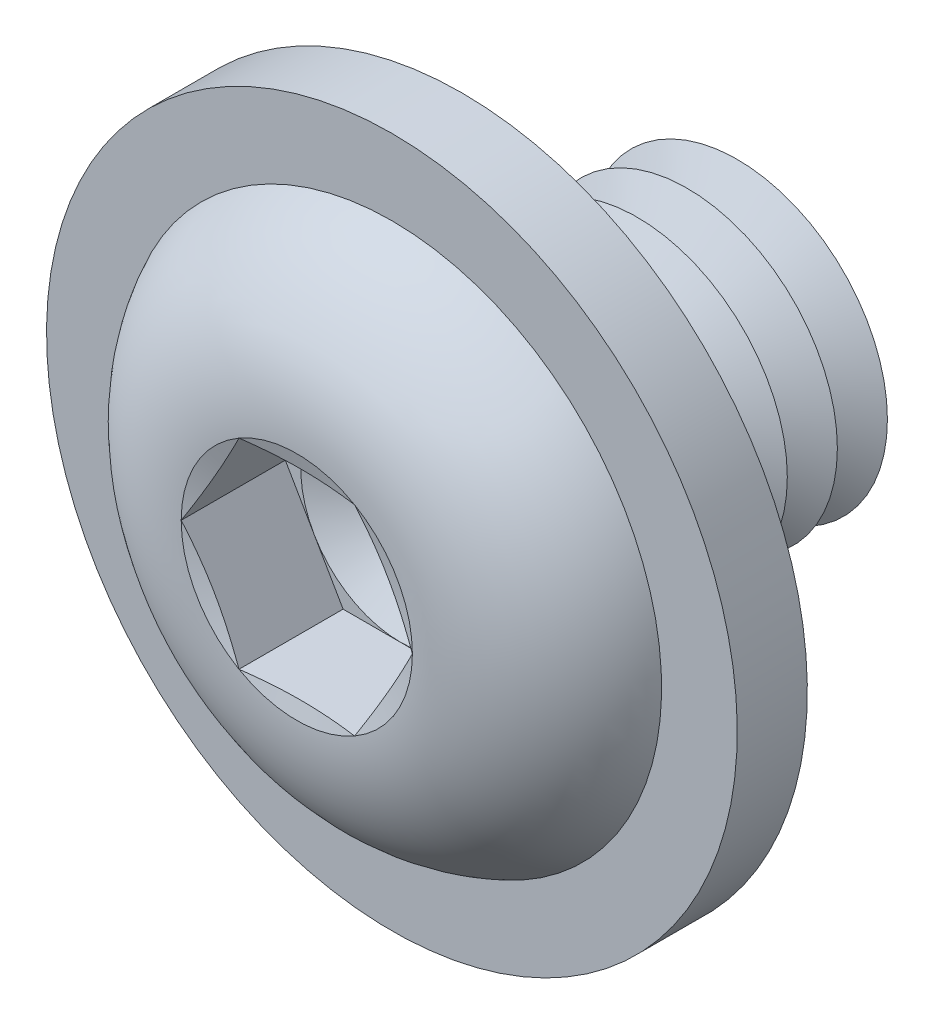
from build123d import *

# Parameters (mm, degrees)
FILLET1_R           = 0.25
LPATTERN1_COUNT     = 6
LPATTERN1_PITCH     = 0.5
CUT_EXTRUDE1_DEPTH  = 1.04
SKETCH5_R           = 3.45
SKETCH5_R_2         = 1.75
BOSS_EXTRUDE1_DEPTH = 0.7


with BuildPart() as part:
    # Sketch1 → Revolve1 (revolve)
    with BuildSketch(Plane(origin=(0, 0, 0), x_dir=(0, 0, -1), z_dir=(1, 0, 0)), mode=Mode.PRIVATE) as revolve1_sk:
        with BuildLine():
            Line((0, 1.5), (0, 2.85))
            ThreePointArc((0, 2.85), (-1.182850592, 2.35063849), (-1.65, 1.1547))
            Line((-1.65, 1.1547), (-1.495299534, 0.57735))
            Line((-1.495299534, 0.57735), (-1.65, 0.57735))
            Line((-1.65, 0.57735), (-1.65, 0))
            Line((-1.65, 0), (3, 0))
            Line((3, 0), (3, 1.5))
            Line((3, 1.5), (0, 1.5))
        make_face()
    revolve(revolve1_sk.sketch.rotate(Axis((0, 0, -3), (0, 0, 1)), 90), axis=Axis((0, 0, -3), (0, 0, 1)))

    # Fillet1
    fillet1_edges = [part.edges().sort_by_distance(p)[0] for p in [
        (1.5, 0, 0),
    ]]
    fillet(fillet1_edges, radius=FILLET1_R)

    # Sketch2 → Cut-Revolve1 (revolve, cut)
    with BuildSketch(Plane(origin=(0, 0, 0), x_dir=(0, 0, -1), z_dir=(1, 0, 0)), mode=Mode.PRIVATE) as cut_revolve1_sk:
        Polygon((2.75, 1.5), (3.25, 1.5), (3, 1.066987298), align=None)
    cut_revolve1 = revolve(cut_revolve1_sk.sketch.rotate(Axis((0, 0, -3), (0, 0, -1)), 270), axis=Axis((0, 0, -3), (0, 0, -1)), mode=Mode.SUBTRACT)

    # LPattern1: Cut-Revolve1 ×6
    with Locations(*[(0, 0, i * LPATTERN1_PITCH) for i in range(1, LPATTERN1_COUNT)]):
        add(cut_revolve1, mode=Mode.SUBTRACT)

    # Sketch3 → Cut-Extrude1 (cut)
    with BuildSketch(Plane.XY.offset(1.65)):
        Polygon((0.57735, 0.999999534), (-0.57735, 0.999999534), (-1.1547, 0), (-0.57735, -0.999999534), (0.57735, -0.999999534), (1.1547, 0), align=None)
    extrude(amount=-CUT_EXTRUDE1_DEPTH, mode=Mode.SUBTRACT)

    # Cut-Extrude2 cone 1 section (on through the dimple's axis) → Cut-Extrude2 (revolve, cut)
    with BuildSketch(Plane(origin=(0, 0, 0.61), x_dir=(0, -1, 0), z_dir=(1, 0, 0))):
        Polygon((0, 0), (0.999999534, 0), (0, 0.57735), align=None)
    revolve(axis=Axis((0, 0, 0.61), (0, 0, -1)), mode=Mode.SUBTRACT)

    # Sketch5 → Boss-Extrude1 (add)
    with BuildSketch(Plane(origin=(0, 0, 0), x_dir=(-1, 0, 0), z_dir=(0, 0, -1))):
        with Locations(Location((0, 0, 0), (0, 0, 90))):
            Circle(SKETCH5_R)
        Circle(SKETCH5_R_2, mode=Mode.SUBTRACT)
    extrude(amount=-BOSS_EXTRUDE1_DEPTH)


solid = part.part
